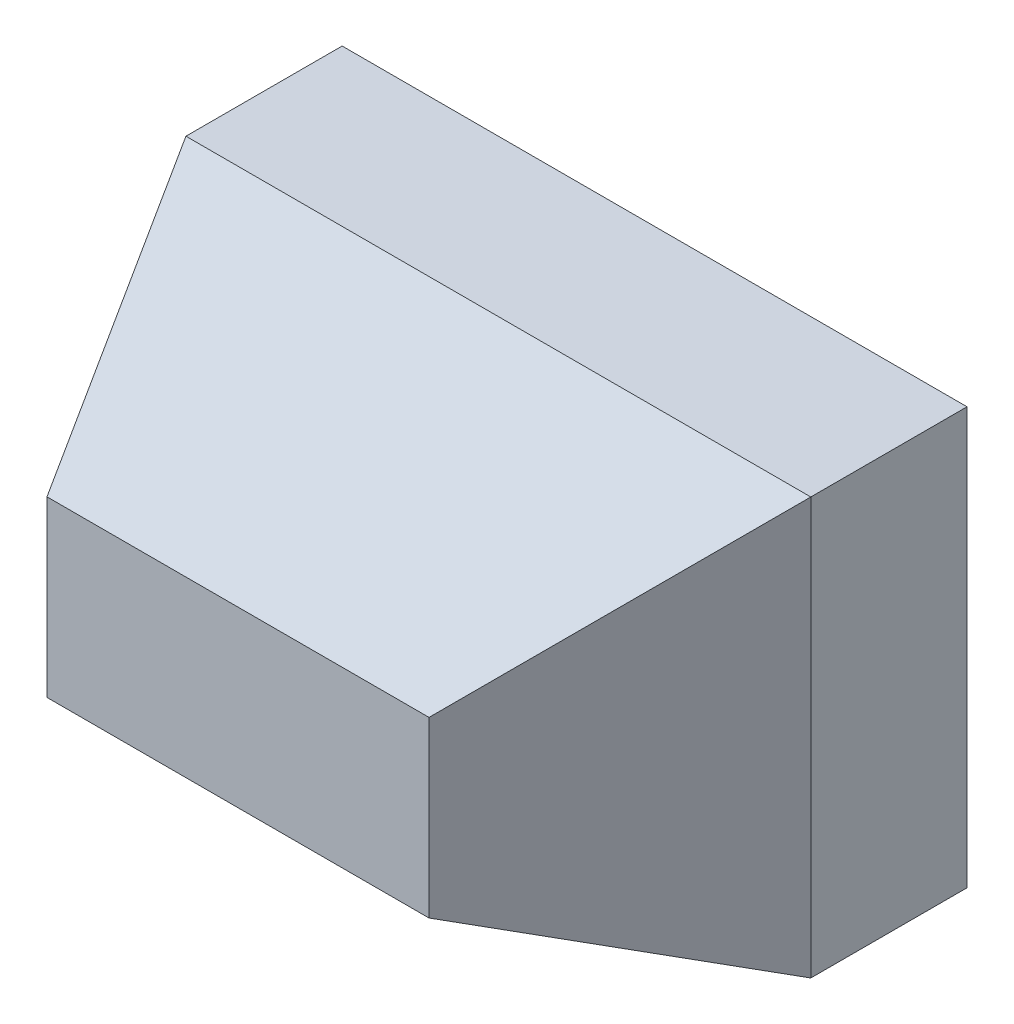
from build123d import *

# Parameters (mm, degrees)
SKETCH_1_W      = 120
SKETCH_1_H      = 80
EXTRUDE_1_DEPTH = 50
EXTRUDE_1_TAPER = 25
SKETCH_2_W      = 120
SKETCH_2_H      = 80
EXTRUDE_2_DEPTH = 30


with BuildPart() as part:
    # Sketch 1 → Extrude 1 (new body)
    with BuildSketch(Plane.XY):
        Rectangle(SKETCH_1_W, SKETCH_1_H)
    extrude(amount=EXTRUDE_1_DEPTH, taper=EXTRUDE_1_TAPER)

    # Sketch 2 → Extrude 2 (add)
    with BuildSketch(Plane(origin=(0, 0, 0), x_dir=(-1, 0, 0), z_dir=(0, 0, -1))):
        Rectangle(SKETCH_2_W, SKETCH_2_H)
    extrude(amount=EXTRUDE_2_DEPTH)


solid = part.part
